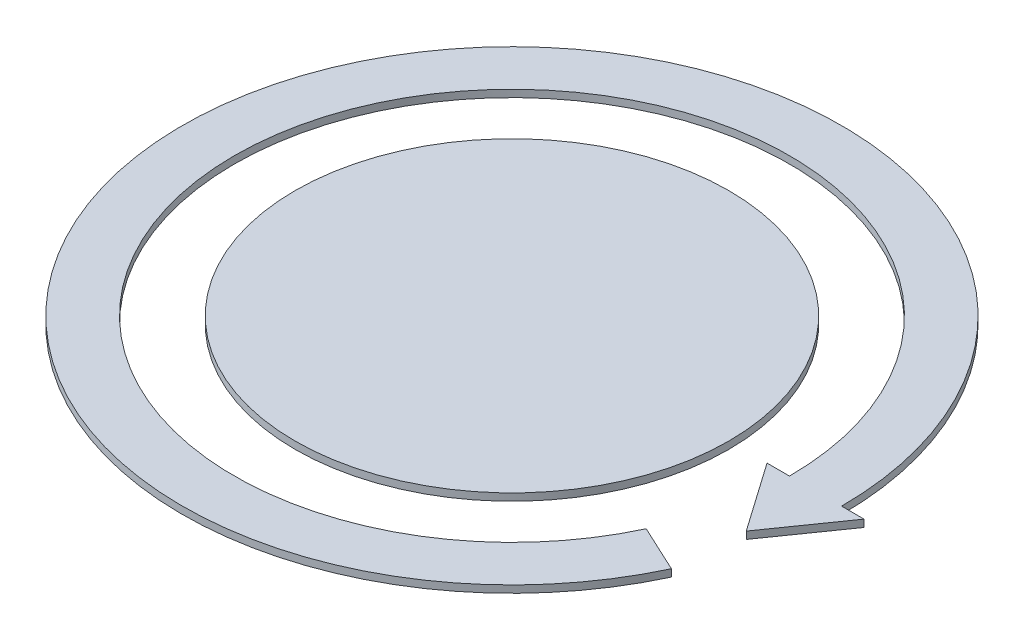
ISO-10303-21;
HEADER;
FILE_DESCRIPTION(('STEP AP214'),'2;1');
FILE_NAME('part.step','',(''),(''),'','','');
FILE_SCHEMA(('AUTOMOTIVE_DESIGN { 1 0 10303 214 1 1 1 1 }'));
ENDSEC;
DATA;
#1=APPLICATION_CONTEXT('core data for automotive mechanical design processes');
#2=APPLICATION_PROTOCOL_DEFINITION('international standard','automotive_design',2000,#1);
#3=PRODUCT_CONTEXT('',#1,'mechanical');
#4=PRODUCT('Part','Part','',(#3));
#5=PRODUCT_RELATED_PRODUCT_CATEGORY('part','',(#4));
#6=PRODUCT_DEFINITION_FORMATION('','',#4);
#7=PRODUCT_DEFINITION_CONTEXT('part definition',#1,'design');
#8=PRODUCT_DEFINITION('design','',#6,#7);
#9=PRODUCT_DEFINITION_SHAPE('','',#8);
#10=(LENGTH_UNIT() NAMED_UNIT(*) SI_UNIT(.MILLI.,.METRE.));
#11=(NAMED_UNIT(*) PLANE_ANGLE_UNIT() SI_UNIT($,.RADIAN.));
#12=(NAMED_UNIT(*) SI_UNIT($,.STERADIAN.) SOLID_ANGLE_UNIT());
#13=UNCERTAINTY_MEASURE_WITH_UNIT(LENGTH_MEASURE(1.E-05),#10,'distance_accuracy_value','');
#14=(GEOMETRIC_REPRESENTATION_CONTEXT(3) GLOBAL_UNCERTAINTY_ASSIGNED_CONTEXT((#13)) GLOBAL_UNIT_ASSIGNED_CONTEXT((#10,
#11,#12)) REPRESENTATION_CONTEXT('',''));
#15=CARTESIAN_POINT('',(0.,0.,0.));
#16=DIRECTION('',(0.,0.,1.));
#17=DIRECTION('',(1.,0.,0.));
#18=AXIS2_PLACEMENT_3D('',#15,#16,#17);
#19=CARTESIAN_POINT('',(0.,2.,0.));
#20=DIRECTION('',(0.,-1.,0.));
#21=DIRECTION('',(0.,0.,-1.));
#22=AXIS2_PLACEMENT_3D('',#19,#20,#21);
#23=CYLINDRICAL_SURFACE('',#22,90.8);
#24=CARTESIAN_POINT('',(0.,0.,0.));
#25=DIRECTION('',(0.,1.,0.));
#26=DIRECTION('',(0.,0.,1.));
#27=AXIS2_PLACEMENT_3D('',#24,#25,#26);
#28=CIRCLE('',#27,90.8);
#29=CARTESIAN_POINT('',(90.8,0.,0.));
#30=VERTEX_POINT('',#29);
#31=CARTESIAN_POINT('',(82.2927470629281,0.,38.373738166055));
#32=VERTEX_POINT('',#31);
#33=EDGE_CURVE('E133',#30,#32,#28,.T.);
#34=ORIENTED_EDGE('',*,*,#33,.T.);
#35=DIRECTION('',(0.,-1.,0.));
#36=VECTOR('',#35,1.);
#37=CARTESIAN_POINT('',(82.2927470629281,2.,38.373738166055));
#38=LINE('',#37,#36);
#39=CARTESIAN_POINT('',(82.2927470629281,2.,38.373738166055));
#40=VERTEX_POINT('',#39);
#41=EDGE_CURVE('E12',#40,#32,#38,.T.);
#42=ORIENTED_EDGE('',*,*,#41,.F.);
#43=CARTESIAN_POINT('',(0.,2.,0.));
#44=DIRECTION('',(0.,1.,0.));
#45=DIRECTION('',(0.,0.,1.));
#46=AXIS2_PLACEMENT_3D('',#43,#44,#45);
#47=CIRCLE('',#46,90.8);
#48=CARTESIAN_POINT('',(90.8,2.,0.));
#49=VERTEX_POINT('',#48);
#50=EDGE_CURVE('E145',#49,#40,#47,.T.);
#51=ORIENTED_EDGE('',*,*,#50,.F.);
#52=DIRECTION('',(0.,-1.,0.));
#53=VECTOR('',#52,1.);
#54=CARTESIAN_POINT('',(90.8,2.,0.));
#55=LINE('',#54,#53);
#56=EDGE_CURVE('E129',#49,#30,#55,.T.);
#57=ORIENTED_EDGE('',*,*,#56,.T.);
#58=EDGE_LOOP('',(#34,#42,#51,#57));
#59=FACE_BOUND('',#58,.T.);
#60=ADVANCED_FACE('F43',(#59),#23,.T.);
#61=CARTESIAN_POINT('',(82.2927470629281,2.,38.373738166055));
#62=DIRECTION('',(-0.422618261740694,0.,0.906307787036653));
#63=DIRECTION('',(0.906307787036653,0.,0.422618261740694));
#64=AXIS2_PLACEMENT_3D('',#61,#62,#63);
#65=PLANE('',#64);
#66=DIRECTION('',(-0.906307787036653,0.,-0.422618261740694));
#67=VECTOR('',#66,1.);
#68=CARTESIAN_POINT('',(82.2927470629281,0.,38.373738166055));
#69=LINE('',#68,#67);
#70=CARTESIAN_POINT('',(69.2872303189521,0.,32.309166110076));
#71=VERTEX_POINT('',#70);
#72=EDGE_CURVE('E136',#32,#71,#69,.T.);
#73=ORIENTED_EDGE('',*,*,#72,.T.);
#74=DIRECTION('',(0.,-1.,0.));
#75=VECTOR('',#74,1.);
#76=CARTESIAN_POINT('',(69.2872303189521,2.,32.309166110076));
#77=LINE('',#76,#75);
#78=CARTESIAN_POINT('',(69.2872303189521,2.,32.309166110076));
#79=VERTEX_POINT('',#78);
#80=EDGE_CURVE('E51',#79,#71,#77,.T.);
#81=ORIENTED_EDGE('',*,*,#80,.F.);
#82=DIRECTION('',(-0.906307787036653,0.,-0.422618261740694));
#83=VECTOR('',#82,1.);
#84=CARTESIAN_POINT('',(82.2927470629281,2.,38.373738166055));
#85=LINE('',#84,#83);
#86=EDGE_CURVE('E99',#40,#79,#85,.T.);
#87=ORIENTED_EDGE('',*,*,#86,.F.);
#88=ORIENTED_EDGE('',*,*,#41,.T.);
#89=EDGE_LOOP('',(#73,#81,#87,#88));
#90=FACE_BOUND('',#89,.T.);
#91=ADVANCED_FACE('F170',(#90),#65,.F.);
#92=CARTESIAN_POINT('',(0.,2.,0.));
#93=DIRECTION('',(0.,-1.,0.));
#94=DIRECTION('',(0.,0.,-1.));
#95=AXIS2_PLACEMENT_3D('',#92,#93,#94);
#96=CYLINDRICAL_SURFACE('',#95,76.45);
#97=CARTESIAN_POINT('',(0.,0.,0.));
#98=DIRECTION('',(0.,-1.,0.));
#99=DIRECTION('',(0.,0.,1.));
#100=AXIS2_PLACEMENT_3D('',#97,#98,#99);
#101=CIRCLE('',#100,76.45);
#102=CARTESIAN_POINT('',(76.45,0.,0.));
#103=VERTEX_POINT('',#102);
#104=EDGE_CURVE('E138',#71,#103,#101,.T.);
#105=ORIENTED_EDGE('',*,*,#104,.T.);
#106=DIRECTION('',(0.,-1.,0.));
#107=VECTOR('',#106,1.);
#108=CARTESIAN_POINT('',(76.45,2.,0.));
#109=LINE('',#108,#107);
#110=CARTESIAN_POINT('',(76.45,2.,0.));
#111=VERTEX_POINT('',#110);
#112=EDGE_CURVE('E149',#111,#103,#109,.T.);
#113=ORIENTED_EDGE('',*,*,#112,.F.);
#114=CARTESIAN_POINT('',(0.,2.,0.));
#115=DIRECTION('',(0.,-1.,0.));
#116=DIRECTION('',(0.,0.,1.));
#117=AXIS2_PLACEMENT_3D('',#114,#115,#116);
#118=CIRCLE('',#117,76.45);
#119=EDGE_CURVE('E157',#79,#111,#118,.T.);
#120=ORIENTED_EDGE('',*,*,#119,.F.);
#121=ORIENTED_EDGE('',*,*,#80,.T.);
#122=EDGE_LOOP('',(#105,#113,#120,#121));
#123=FACE_BOUND('',#122,.T.);
#124=ADVANCED_FACE('F155',(#123),#96,.F.);
#125=CARTESIAN_POINT('',(70.2655905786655,2.,0.));
#126=DIRECTION('',(0.,0.,1.));
#127=DIRECTION('',(1.,0.,0.));
#128=AXIS2_PLACEMENT_3D('',#125,#126,#127);
#129=PLANE('',#128);
#130=DIRECTION('',(-1.,0.,0.));
#131=VECTOR('',#130,1.);
#132=CARTESIAN_POINT('',(70.2655905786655,0.,0.));
#133=LINE('',#132,#131);
#134=CARTESIAN_POINT('',(70.2655905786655,0.,0.));
#135=VERTEX_POINT('',#134);
#136=EDGE_CURVE('E140',#103,#135,#133,.T.);
#137=ORIENTED_EDGE('',*,*,#136,.T.);
#138=DIRECTION('',(0.,-1.,0.));
#139=VECTOR('',#138,1.);
#140=CARTESIAN_POINT('',(70.2655905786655,2.,0.));
#141=LINE('',#140,#139);
#142=CARTESIAN_POINT('',(70.2655905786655,2.,0.));
#143=VERTEX_POINT('',#142);
#144=EDGE_CURVE('E124',#143,#135,#141,.T.);
#145=ORIENTED_EDGE('',*,*,#144,.F.);
#146=DIRECTION('',(-1.,0.,0.));
#147=VECTOR('',#146,1.);
#148=CARTESIAN_POINT('',(70.2655905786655,2.,0.));
#149=LINE('',#148,#147);
#150=EDGE_CURVE('E115',#111,#143,#149,.T.);
#151=ORIENTED_EDGE('',*,*,#150,.F.);
#152=ORIENTED_EDGE('',*,*,#112,.T.);
#153=EDGE_LOOP('',(#137,#145,#151,#152));
#154=FACE_BOUND('',#153,.T.);
#155=ADVANCED_FACE('F163',(#154),#129,.F.);
#156=CARTESIAN_POINT('',(83.625,2.,19.0792139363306));
#157=DIRECTION('',(0.819152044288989,0.,-0.57357643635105));
#158=DIRECTION('',(-0.57357643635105,0.,-0.819152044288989));
#159=AXIS2_PLACEMENT_3D('',#156,#157,#158);
#160=PLANE('',#159);
#161=DIRECTION('',(0.57357643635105,0.,0.819152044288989));
#162=VECTOR('',#161,1.);
#163=CARTESIAN_POINT('',(83.625,0.,19.0792139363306));
#164=LINE('',#163,#162);
#165=CARTESIAN_POINT('',(83.625,0.,19.0792139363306));
#166=VERTEX_POINT('',#165);
#167=EDGE_CURVE('E123',#135,#166,#164,.T.);
#168=ORIENTED_EDGE('',*,*,#167,.T.);
#169=DIRECTION('',(0.,-1.,0.));
#170=VECTOR('',#169,1.);
#171=CARTESIAN_POINT('',(83.625,2.,19.0792139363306));
#172=LINE('',#171,#170);
#173=CARTESIAN_POINT('',(83.625,2.,19.0792139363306));
#174=VERTEX_POINT('',#173);
#175=EDGE_CURVE('E120',#174,#166,#172,.T.);
#176=ORIENTED_EDGE('',*,*,#175,.F.);
#177=DIRECTION('',(0.57357643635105,0.,0.819152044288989));
#178=VECTOR('',#177,1.);
#179=CARTESIAN_POINT('',(83.625,2.,19.0792139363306));
#180=LINE('',#179,#178);
#181=EDGE_CURVE('E109',#143,#174,#180,.T.);
#182=ORIENTED_EDGE('',*,*,#181,.F.);
#183=ORIENTED_EDGE('',*,*,#144,.T.);
#184=EDGE_LOOP('',(#168,#176,#182,#183));
#185=FACE_BOUND('',#184,.T.);
#186=ADVANCED_FACE('F121',(#185),#160,.F.);
#187=CARTESIAN_POINT('',(96.9844094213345,2.,0.));
#188=DIRECTION('',(-0.819152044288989,0.,-0.57357643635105));
#189=DIRECTION('',(-0.57357643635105,0.,0.819152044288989));
#190=AXIS2_PLACEMENT_3D('',#187,#188,#189);
#191=PLANE('',#190);
#192=DIRECTION('',(0.57357643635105,0.,-0.819152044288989));
#193=VECTOR('',#192,1.);
#194=CARTESIAN_POINT('',(96.9844094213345,0.,0.));
#195=LINE('',#194,#193);
#196=CARTESIAN_POINT('',(96.9844094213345,0.,0.));
#197=VERTEX_POINT('',#196);
#198=EDGE_CURVE('E85',#166,#197,#195,.T.);
#199=ORIENTED_EDGE('',*,*,#198,.T.);
#200=DIRECTION('',(0.,-1.,0.));
#201=VECTOR('',#200,1.);
#202=CARTESIAN_POINT('',(96.9844094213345,2.,0.));
#203=LINE('',#202,#201);
#204=CARTESIAN_POINT('',(96.9844094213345,2.,0.));
#205=VERTEX_POINT('',#204);
#206=EDGE_CURVE('E125',#205,#197,#203,.T.);
#207=ORIENTED_EDGE('',*,*,#206,.F.);
#208=DIRECTION('',(0.57357643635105,0.,-0.819152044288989));
#209=VECTOR('',#208,1.);
#210=CARTESIAN_POINT('',(96.9844094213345,2.,0.));
#211=LINE('',#210,#209);
#212=EDGE_CURVE('E113',#174,#205,#211,.T.);
#213=ORIENTED_EDGE('',*,*,#212,.F.);
#214=ORIENTED_EDGE('',*,*,#175,.T.);
#215=EDGE_LOOP('',(#199,#207,#213,#214));
#216=FACE_BOUND('',#215,.T.);
#217=ADVANCED_FACE('F127',(#216),#191,.F.);
#218=CARTESIAN_POINT('',(90.8,2.,0.));
#219=DIRECTION('',(0.,0.,1.));
#220=DIRECTION('',(1.,0.,0.));
#221=AXIS2_PLACEMENT_3D('',#218,#219,#220);
#222=PLANE('',#221);
#223=DIRECTION('',(-1.,0.,0.));
#224=VECTOR('',#223,1.);
#225=CARTESIAN_POINT('',(90.8,0.,0.));
#226=LINE('',#225,#224);
#227=EDGE_CURVE('E91',#197,#30,#226,.T.);
#228=ORIENTED_EDGE('',*,*,#227,.T.);
#229=ORIENTED_EDGE('',*,*,#56,.F.);
#230=DIRECTION('',(-1.,0.,0.));
#231=VECTOR('',#230,1.);
#232=CARTESIAN_POINT('',(90.8,2.,0.));
#233=LINE('',#232,#231);
#234=EDGE_CURVE('E59',#205,#49,#233,.T.);
#235=ORIENTED_EDGE('',*,*,#234,.F.);
#236=ORIENTED_EDGE('',*,*,#206,.T.);
#237=EDGE_LOOP('',(#228,#229,#235,#236));
#238=FACE_BOUND('',#237,.T.);
#239=ADVANCED_FACE('F184',(#238),#222,.F.);
#240=CARTESIAN_POINT('',(0.,2.,0.));
#241=DIRECTION('',(0.,1.,0.));
#242=DIRECTION('',(0.,0.,1.));
#243=AXIS2_PLACEMENT_3D('',#240,#241,#242);
#244=PLANE('',#243);
#245=ORIENTED_EDGE('',*,*,#50,.T.);
#246=ORIENTED_EDGE('',*,*,#86,.T.);
#247=ORIENTED_EDGE('',*,*,#119,.T.);
#248=ORIENTED_EDGE('',*,*,#150,.T.);
#249=ORIENTED_EDGE('',*,*,#181,.T.);
#250=ORIENTED_EDGE('',*,*,#212,.T.);
#251=ORIENTED_EDGE('',*,*,#234,.T.);
#252=EDGE_LOOP('',(#245,#246,#247,#248,#249,#250,#251));
#253=FACE_BOUND('',#252,.T.);
#254=ADVANCED_FACE('F111',(#253),#244,.T.);
#255=CARTESIAN_POINT('',(0.,0.,0.));
#256=DIRECTION('',(0.,1.,0.));
#257=DIRECTION('',(0.,0.,1.));
#258=AXIS2_PLACEMENT_3D('',#255,#256,#257);
#259=PLANE('',#258);
#260=ORIENTED_EDGE('',*,*,#33,.F.);
#261=ORIENTED_EDGE('',*,*,#227,.F.);
#262=ORIENTED_EDGE('',*,*,#198,.F.);
#263=ORIENTED_EDGE('',*,*,#167,.F.);
#264=ORIENTED_EDGE('',*,*,#136,.F.);
#265=ORIENTED_EDGE('',*,*,#104,.F.);
#266=ORIENTED_EDGE('',*,*,#72,.F.);
#267=EDGE_LOOP('',(#260,#261,#262,#263,#264,#265,#266));
#268=FACE_BOUND('',#267,.T.);
#269=ADVANCED_FACE('F161',(#268),#259,.F.);
#270=CLOSED_SHELL('',(#60,#91,#124,#155,#186,#217,#239,#254,#269));
#271=MANIFOLD_SOLID_BREP('B2',#270);
#272=CARTESIAN_POINT('',(0.,2.,0.));
#273=DIRECTION('',(0.,-1.,0.));
#274=DIRECTION('',(0.,0.,-1.));
#275=AXIS2_PLACEMENT_3D('',#272,#273,#274);
#276=CYLINDRICAL_SURFACE('',#275,59.75);
#277=CARTESIAN_POINT('',(0.,2.,0.));
#278=DIRECTION('',(0.,1.,0.));
#279=DIRECTION('',(0.,0.,1.));
#280=AXIS2_PLACEMENT_3D('',#277,#278,#279);
#281=CIRCLE('',#280,59.75);
#282=CARTESIAN_POINT('',(0.,2.,59.75));
#283=VERTEX_POINT('',#282);
#284=EDGE_CURVE('E42',#283,#283,#281,.T.);
#285=ORIENTED_EDGE('',*,*,#284,.F.);
#286=EDGE_LOOP('',(#285));
#287=FACE_BOUND('',#286,.T.);
#288=CARTESIAN_POINT('',(0.,0.,0.));
#289=DIRECTION('',(0.,1.,0.));
#290=DIRECTION('',(0.,0.,1.));
#291=AXIS2_PLACEMENT_3D('',#288,#289,#290);
#292=CIRCLE('',#291,59.75);
#293=CARTESIAN_POINT('',(0.,0.,59.75));
#294=VERTEX_POINT('',#293);
#295=EDGE_CURVE('E248',#294,#294,#292,.T.);
#296=ORIENTED_EDGE('',*,*,#295,.T.);
#297=EDGE_LOOP('',(#296));
#298=FACE_BOUND('',#297,.T.);
#299=ADVANCED_FACE('F245',(#287,#298),#276,.T.);
#300=CARTESIAN_POINT('',(0.,2.,0.));
#301=DIRECTION('',(0.,1.,0.));
#302=DIRECTION('',(0.,0.,1.));
#303=AXIS2_PLACEMENT_3D('',#300,#301,#302);
#304=PLANE('',#303);
#305=ORIENTED_EDGE('',*,*,#284,.T.);
#306=EDGE_LOOP('',(#305));
#307=FACE_BOUND('',#306,.T.);
#308=ADVANCED_FACE('F260',(#307),#304,.T.);
#309=CARTESIAN_POINT('',(0.,0.,0.));
#310=DIRECTION('',(0.,1.,0.));
#311=DIRECTION('',(0.,0.,1.));
#312=AXIS2_PLACEMENT_3D('',#309,#310,#311);
#313=PLANE('',#312);
#314=ORIENTED_EDGE('',*,*,#295,.F.);
#315=EDGE_LOOP('',(#314));
#316=FACE_BOUND('',#315,.T.);
#317=ADVANCED_FACE('F258',(#316),#313,.F.);
#318=CLOSED_SHELL('',(#299,#308,#317));
#319=MANIFOLD_SOLID_BREP('B6',#318);
#320=ADVANCED_BREP_SHAPE_REPRESENTATION('',(#18,#271,#319),#14);
#321=SHAPE_DEFINITION_REPRESENTATION(#9,#320);
ENDSEC;
END-ISO-10303-21;
